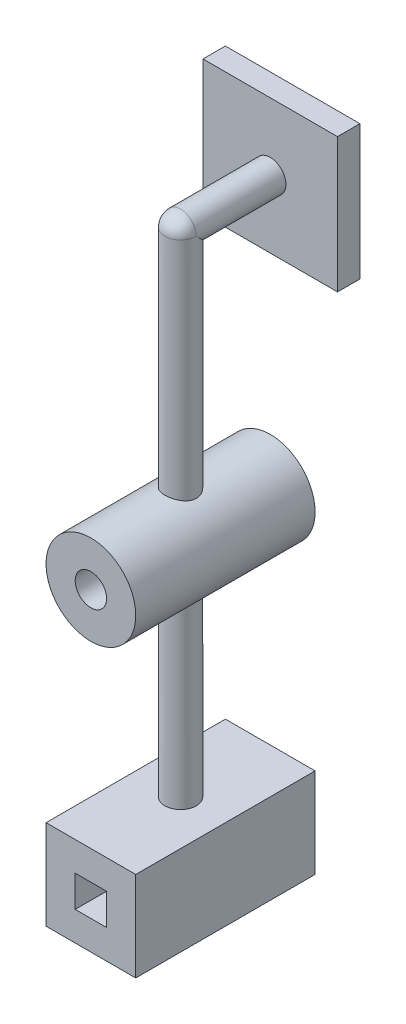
from build123d import *

# Parameters (mm, degrees)
BASE_EXTRUSION_DEPTH      = 20
BASE_EXTRUSION_DEPTH_BACK = 20
ESQUISSE1_R               = 10
ESQUISSE1_R_2             = 3.5
ESQUISSE2_R               = 3.5
BOSS_EXTRU_2_DEPTH        = 60
ESQUISSE3_R               = 3.5
BOSS_EXTRU_3_DEPTH        = 20
ESQUISSE5_W               = 30
ESQUISSE5_H               = 30
BOSS_EXTRU_4_DEPTH        = 5
ESQUISSE7_R               = 3.5
ENL_V_MAT_EXTRU_1_DEPTH   = 89.741196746
BOSS_EXTRU_9_START        = -50
ESQUISSE8_R               = 3.5
BOSS_EXTRU_9_DEPTH        = 50
ESQUISSE9_W               = 20
ESQUISSE9_H               = 40
BOSS_EXTRU_10_DEPTH       = 20
ESQUISSE10_W              = 7
ESQUISSE10_H              = 7
ENL_V_MAT_EXTRU_2_DEPTH   = 89.741196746
ESQUISSE11_R              = 3.5
ENL_V_MAT_EXTRU_3_DEPTH   = 89.741196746


with BuildPart() as part:
    # Esquisse1 → Base-Extrusion (new, two sides: drawn at the far end of the back side and taken through both)
    with BuildSketch(Plane.XY.offset(-BASE_EXTRUSION_DEPTH_BACK)):
        Circle(ESQUISSE1_R)
        Circle(ESQUISSE1_R_2, mode=Mode.SUBTRACT)
    extrude(amount=BASE_EXTRUSION_DEPTH + BASE_EXTRUSION_DEPTH_BACK)

    # Esquisse2 → Boss.-Extru.2 (add)
    with BuildSketch(Plane(origin=(0, 0, 0), x_dir=(1, 0, 0), z_dir=(0, 1, 0))):
        with Locations(Location((0, 0, 0), (0, 0, 90))):
            Circle(ESQUISSE2_R)
    extrude(amount=BOSS_EXTRU_2_DEPTH)

    # Esquisse3 → Boss.-Extru.3 (add)
    with BuildSketch(Plane.XY):
        with Locations((0, 60)):
            Circle(ESQUISSE3_R)
    extrude(amount=-BOSS_EXTRU_3_DEPTH)

    # Esquisse4 → Boss.-R_vol.1 (revolve)
    with BuildSketch(Plane(origin=(0, 0, 0), x_dir=(0, 0, -1), z_dir=(1, 0, 0))):
        with BuildLine():
            Line((0, 56.5), (0, 63.5))
            ThreePointArc((0, 63.5), (-3.5, 60), (0, 56.5))
        make_face()
    revolve(axis=Axis((0, 65.544421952, 0), (0, -1, 0)))

    # Esquisse5 → Boss.-Extru.4 (add)
    with BuildSketch(Plane(origin=(0, 0, -20), x_dir=(-1, 0, 0), z_dir=(0, 0, -1))):
        with Locations((0, 60)):
            Rectangle(ESQUISSE5_W, ESQUISSE5_H)
    extrude(amount=BOSS_EXTRU_4_DEPTH)

    # Esquisse7 → Enl_v. mat.-Extru.1 (cut, through all)
    with BuildSketch(Plane.XY.offset(20)):
        Circle(ESQUISSE7_R)
    extrude(amount=-ENL_V_MAT_EXTRU_1_DEPTH, mode=Mode.SUBTRACT)

    # Esquisse8 → Boss.-Extru.9 (add)
    with BuildSketch(Plane(origin=(0, 0, 0), x_dir=(1, 0, 0), z_dir=(0, 1, 0)).offset(BOSS_EXTRU_9_START)):
        with Locations(Location((0, 0, 0), (0, 0, 90))):
            Circle(ESQUISSE8_R)
    extrude(amount=BOSS_EXTRU_9_DEPTH)

    # Esquisse9 → Boss.-Extru.10 (add)
    with BuildSketch(Plane.XZ.offset(50)):
        Rectangle(ESQUISSE9_W, ESQUISSE9_H)
    extrude(amount=BOSS_EXTRU_10_DEPTH)

    # Esquisse10 → Enl_v. mat.-Extru.2 (cut, through all)
    with BuildSketch(Plane.XY.offset(20)):
        with Locations((0, -60)):
            Rectangle(ESQUISSE10_W, ESQUISSE10_H)
    extrude(amount=-ENL_V_MAT_EXTRU_2_DEPTH, mode=Mode.SUBTRACT)

    # Esquisse11 → Enl_v. mat.-Extru.3 (cut, through all)
    with BuildSketch(Plane.XY.offset(20)):
        Circle(ESQUISSE11_R)
    extrude(amount=-ENL_V_MAT_EXTRU_3_DEPTH, mode=Mode.SUBTRACT)


solid = part.part
